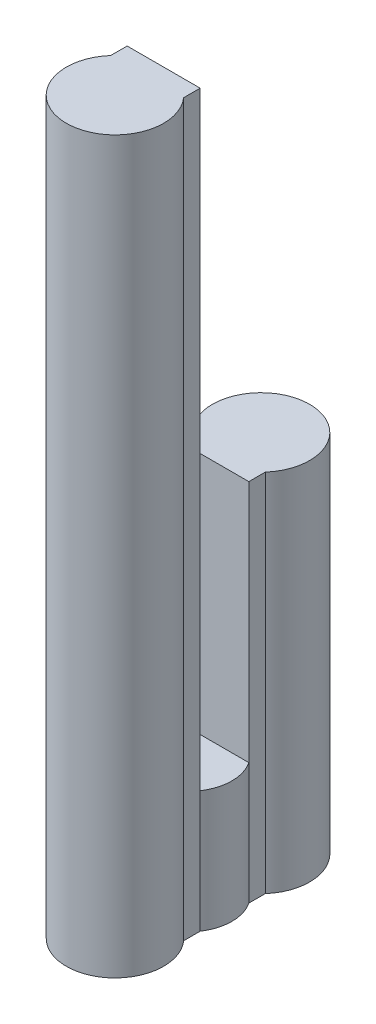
from build123d import *

# Parameters (mm, degrees)
EXTRUDE_1_DEPTH = 15
EXTRUDE_2_DEPTH = 30
SKETCH_3_R      = 1.802775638
EXTRUDE_3_DEPTH = 5


with BuildPart() as part:
    # Sketch 1 → Extrude 1 (new body)
    with BuildSketch(Plane(origin=(0, 0, 0), x_dir=(1, 0, 0), z_dir=(0, 1, 0))):
        with BuildLine():
            Line((-1.5, 0), (1.5, 0))
            Line((1.5, 0), (1.5, 0.677124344))
            ThreePointArc((1.5, 0.677124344), (0, 4), (-1.5, 0.677124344))
            Line((-1.5, 0.677124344), (-1.5, 0))
        make_face()
    extrude(amount=EXTRUDE_1_DEPTH)



with BuildPart() as body_2:
    # Sketch 2 → Extrude 2 (new body)
    with BuildSketch(Plane.XZ):
        with BuildLine():
            Line((1.5, 2), (-1.5, 2))
            Line((-1.5, 2), (-1.5, 2.677124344))
            ThreePointArc((-1.5, 2.677124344), (0, 6), (1.5, 2.677124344))
            Line((1.5, 2.677124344), (1.5, 2))
        make_face()
    extrude(amount=-EXTRUDE_2_DEPTH)


with BuildPart() as part_1:
    add(part.part)

    add(body_2.part)  # Extrude 3 merges body 2
    # Sketch 3 → Extrude 3 (add)
    with BuildSketch(Plane.XZ):
        with Locations((0, 1)):
            Circle(SKETCH_3_R)
    extrude(amount=-EXTRUDE_3_DEPTH)


solid = part_1.part
